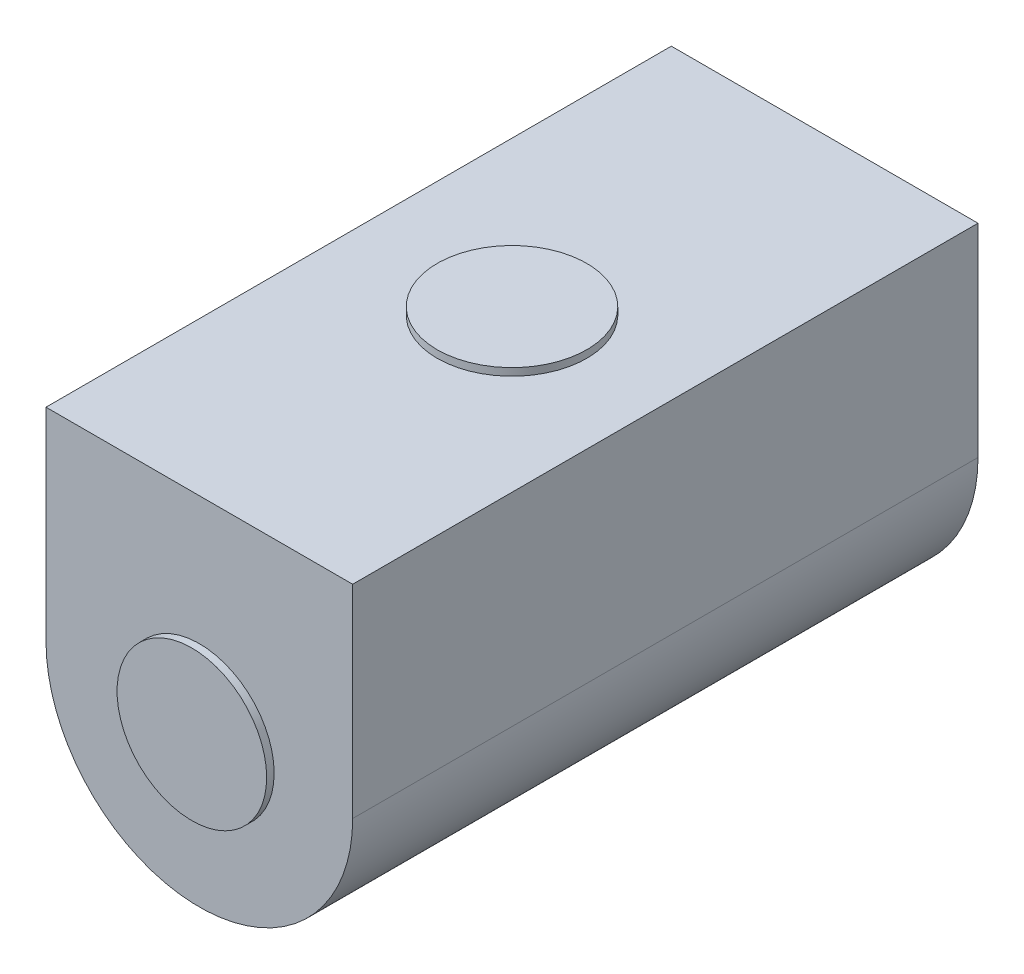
ISO-10303-21;
HEADER;
FILE_DESCRIPTION(('STEP AP214'),'2;1');
FILE_NAME('part.step','',(''),(''),'','','');
FILE_SCHEMA(('AUTOMOTIVE_DESIGN { 1 0 10303 214 1 1 1 1 }'));
ENDSEC;
DATA;
#1=APPLICATION_CONTEXT('core data for automotive mechanical design processes');
#2=APPLICATION_PROTOCOL_DEFINITION('international standard','automotive_design',2000,#1);
#3=PRODUCT_CONTEXT('',#1,'mechanical');
#4=PRODUCT('Part','Part','',(#3));
#5=PRODUCT_RELATED_PRODUCT_CATEGORY('part','',(#4));
#6=PRODUCT_DEFINITION_FORMATION('','',#4);
#7=PRODUCT_DEFINITION_CONTEXT('part definition',#1,'design');
#8=PRODUCT_DEFINITION('design','',#6,#7);
#9=PRODUCT_DEFINITION_SHAPE('','',#8);
#10=(LENGTH_UNIT() NAMED_UNIT(*) SI_UNIT(.MILLI.,.METRE.));
#11=(NAMED_UNIT(*) PLANE_ANGLE_UNIT() SI_UNIT($,.RADIAN.));
#12=(NAMED_UNIT(*) SI_UNIT($,.STERADIAN.) SOLID_ANGLE_UNIT());
#13=UNCERTAINTY_MEASURE_WITH_UNIT(LENGTH_MEASURE(1.E-05),#10,'distance_accuracy_value','');
#14=(GEOMETRIC_REPRESENTATION_CONTEXT(3) GLOBAL_UNCERTAINTY_ASSIGNED_CONTEXT((#13)) GLOBAL_UNIT_ASSIGNED_CONTEXT((#10,
#11,#12)) REPRESENTATION_CONTEXT('',''));
#15=CARTESIAN_POINT('',(0.,0.,0.));
#16=DIRECTION('',(0.,0.,1.));
#17=DIRECTION('',(1.,0.,0.));
#18=AXIS2_PLACEMENT_3D('',#15,#16,#17);
#19=CARTESIAN_POINT('',(0.,13.5625,20.9));
#20=DIRECTION('',(0.,1.,0.));
#21=DIRECTION('',(0.,0.,1.));
#22=AXIS2_PLACEMENT_3D('',#19,#20,#21);
#23=PLANE('',#22);
#24=DIRECTION('',(1.,0.,0.));
#25=VECTOR('',#24,1.);
#26=CARTESIAN_POINT('',(0.,13.5625,-20.9));
#27=LINE('',#26,#25);
#28=CARTESIAN_POINT('',(-10.25,13.5625,-20.9));
#29=VERTEX_POINT('',#28);
#30=CARTESIAN_POINT('',(10.25,13.5625,-20.9));
#31=VERTEX_POINT('',#30);
#32=EDGE_CURVE('E119',#29,#31,#27,.T.);
#33=ORIENTED_EDGE('',*,*,#32,.F.);
#34=DIRECTION('',(0.,0.,-1.));
#35=VECTOR('',#34,1.);
#36=CARTESIAN_POINT('',(-10.25,13.5625,20.9));
#37=LINE('',#36,#35);
#38=CARTESIAN_POINT('',(-10.25,13.5625,20.9));
#39=VERTEX_POINT('',#38);
#40=EDGE_CURVE('E65',#39,#29,#37,.T.);
#41=ORIENTED_EDGE('',*,*,#40,.F.);
#42=DIRECTION('',(1.,0.,0.));
#43=VECTOR('',#42,1.);
#44=CARTESIAN_POINT('',(0.,13.5625,20.9));
#45=LINE('',#44,#43);
#46=CARTESIAN_POINT('',(10.25,13.5625,20.9));
#47=VERTEX_POINT('',#46);
#48=EDGE_CURVE('E108',#39,#47,#45,.T.);
#49=ORIENTED_EDGE('',*,*,#48,.T.);
#50=DIRECTION('',(0.,0.,-1.));
#51=VECTOR('',#50,1.);
#52=CARTESIAN_POINT('',(10.25,13.5625,20.9));
#53=LINE('',#52,#51);
#54=EDGE_CURVE('E78',#47,#31,#53,.T.);
#55=ORIENTED_EDGE('',*,*,#54,.T.);
#56=EDGE_LOOP('',(#33,#41,#49,#55));
#57=FACE_BOUND('',#56,.T.);
#58=CARTESIAN_POINT('',(0.,13.5625,0.));
#59=DIRECTION('',(0.,1.,0.));
#60=DIRECTION('',(0.,0.,1.));
#61=AXIS2_PLACEMENT_3D('',#58,#59,#60);
#62=CIRCLE('',#61,5.);
#63=CARTESIAN_POINT('',(0.,13.5625,5.));
#64=VERTEX_POINT('',#63);
#65=EDGE_CURVE('E137',#64,#64,#62,.T.);
#66=ORIENTED_EDGE('',*,*,#65,.F.);
#67=EDGE_LOOP('',(#66));
#68=FACE_BOUND('',#67,.T.);
#69=ADVANCED_FACE('F48',(#57,#68),#23,.T.);
#70=CARTESIAN_POINT('',(0.,-22.9250469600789,20.9));
#71=DIRECTION('',(0.,0.,1.));
#72=DIRECTION('',(1.,0.,0.));
#73=AXIS2_PLACEMENT_3D('',#70,#71,#72);
#74=PLANE('',#73);
#75=DIRECTION('',(0.,1.,0.));
#76=VECTOR('',#75,1.);
#77=CARTESIAN_POINT('',(-10.25,-22.9250469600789,20.9));
#78=LINE('',#77,#76);
#79=CARTESIAN_POINT('',(-10.25,0.,20.9));
#80=VERTEX_POINT('',#79);
#81=EDGE_CURVE('E98',#80,#39,#78,.T.);
#82=ORIENTED_EDGE('',*,*,#81,.F.);
#83=CARTESIAN_POINT('',(0.,0.,20.9));
#84=DIRECTION('',(0.,0.,1.));
#85=DIRECTION('',(1.,0.,0.));
#86=AXIS2_PLACEMENT_3D('',#83,#84,#85);
#87=CIRCLE('',#86,10.25);
#88=CARTESIAN_POINT('',(10.25,0.,20.9));
#89=VERTEX_POINT('',#88);
#90=EDGE_CURVE('E91',#80,#89,#87,.T.);
#91=ORIENTED_EDGE('',*,*,#90,.T.);
#92=DIRECTION('',(0.,-1.,0.));
#93=VECTOR('',#92,1.);
#94=CARTESIAN_POINT('',(10.25,-22.9250469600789,20.9));
#95=LINE('',#94,#93);
#96=EDGE_CURVE('E97',#47,#89,#95,.T.);
#97=ORIENTED_EDGE('',*,*,#96,.F.);
#98=ORIENTED_EDGE('',*,*,#48,.F.);
#99=EDGE_LOOP('',(#82,#91,#97,#98));
#100=FACE_BOUND('',#99,.T.);
#101=CARTESIAN_POINT('',(0.,0.,20.9));
#102=DIRECTION('',(0.,0.,1.));
#103=DIRECTION('',(1.,0.,0.));
#104=AXIS2_PLACEMENT_3D('',#101,#102,#103);
#105=CIRCLE('',#104,5.);
#106=CARTESIAN_POINT('',(5.,0.,20.9));
#107=VERTEX_POINT('',#106);
#108=EDGE_CURVE('E125',#107,#107,#105,.T.);
#109=ORIENTED_EDGE('',*,*,#108,.F.);
#110=EDGE_LOOP('',(#109));
#111=FACE_BOUND('',#110,.T.);
#112=ADVANCED_FACE('F93',(#100,#111),#74,.T.);
#113=CARTESIAN_POINT('',(0.,0.,20.9));
#114=DIRECTION('',(0.,0.,-1.));
#115=DIRECTION('',(-1.,0.,0.));
#116=AXIS2_PLACEMENT_3D('',#113,#114,#115);
#117=CYLINDRICAL_SURFACE('',#116,10.25);
#118=CARTESIAN_POINT('',(0.,0.,-20.9));
#119=DIRECTION('',(0.,0.,1.));
#120=DIRECTION('',(1.,0.,0.));
#121=AXIS2_PLACEMENT_3D('',#118,#119,#120);
#122=CIRCLE('',#121,10.25);
#123=CARTESIAN_POINT('',(-10.25,0.,-20.9));
#124=VERTEX_POINT('',#123);
#125=CARTESIAN_POINT('',(10.25,0.,-20.9));
#126=VERTEX_POINT('',#125);
#127=EDGE_CURVE('E104',#124,#126,#122,.T.);
#128=ORIENTED_EDGE('',*,*,#127,.T.);
#129=DIRECTION('',(0.,0.,-1.));
#130=VECTOR('',#129,1.);
#131=CARTESIAN_POINT('',(10.25,0.,20.9));
#132=LINE('',#131,#130);
#133=EDGE_CURVE('E57',#89,#126,#132,.T.);
#134=ORIENTED_EDGE('',*,*,#133,.F.);
#135=ORIENTED_EDGE('',*,*,#90,.F.);
#136=DIRECTION('',(0.,0.,-1.));
#137=VECTOR('',#136,1.);
#138=CARTESIAN_POINT('',(-10.25,0.,20.9));
#139=LINE('',#138,#137);
#140=EDGE_CURVE('E12',#80,#124,#139,.T.);
#141=ORIENTED_EDGE('',*,*,#140,.T.);
#142=EDGE_LOOP('',(#128,#134,#135,#141));
#143=FACE_BOUND('',#142,.T.);
#144=ADVANCED_FACE('F102',(#143),#117,.T.);
#145=CARTESIAN_POINT('',(10.25,-22.9250469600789,20.9));
#146=DIRECTION('',(1.,0.,0.));
#147=DIRECTION('',(0.,0.,-1.));
#148=AXIS2_PLACEMENT_3D('',#145,#146,#147);
#149=PLANE('',#148);
#150=DIRECTION('',(0.,-1.,0.));
#151=VECTOR('',#150,1.);
#152=CARTESIAN_POINT('',(10.25,-22.9250469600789,-20.9));
#153=LINE('',#152,#151);
#154=EDGE_CURVE('E117',#31,#126,#153,.T.);
#155=ORIENTED_EDGE('',*,*,#154,.F.);
#156=ORIENTED_EDGE('',*,*,#54,.F.);
#157=ORIENTED_EDGE('',*,*,#96,.T.);
#158=ORIENTED_EDGE('',*,*,#133,.T.);
#159=EDGE_LOOP('',(#155,#156,#157,#158));
#160=FACE_BOUND('',#159,.T.);
#161=ADVANCED_FACE('F107',(#160),#149,.T.);
#162=CARTESIAN_POINT('',(-10.25,-22.9250469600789,20.9));
#163=DIRECTION('',(-1.,0.,0.));
#164=DIRECTION('',(0.,0.,1.));
#165=AXIS2_PLACEMENT_3D('',#162,#163,#164);
#166=PLANE('',#165);
#167=DIRECTION('',(0.,1.,0.));
#168=VECTOR('',#167,1.);
#169=CARTESIAN_POINT('',(-10.25,-22.9250469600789,-20.9));
#170=LINE('',#169,#168);
#171=EDGE_CURVE('E113',#124,#29,#170,.T.);
#172=ORIENTED_EDGE('',*,*,#171,.F.);
#173=ORIENTED_EDGE('',*,*,#140,.F.);
#174=ORIENTED_EDGE('',*,*,#81,.T.);
#175=ORIENTED_EDGE('',*,*,#40,.T.);
#176=EDGE_LOOP('',(#172,#173,#174,#175));
#177=FACE_BOUND('',#176,.T.);
#178=ADVANCED_FACE('F50',(#177),#166,.T.);
#179=CARTESIAN_POINT('',(0.,-22.9250469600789,-20.9));
#180=DIRECTION('',(0.,0.,1.));
#181=DIRECTION('',(1.,0.,0.));
#182=AXIS2_PLACEMENT_3D('',#179,#180,#181);
#183=PLANE('',#182);
#184=CARTESIAN_POINT('',(0.,0.,-20.9));
#185=DIRECTION('',(0.,0.,1.));
#186=DIRECTION('',(1.,0.,0.));
#187=AXIS2_PLACEMENT_3D('',#184,#185,#186);
#188=CIRCLE('',#187,5.);
#189=CARTESIAN_POINT('',(5.,0.,-20.9));
#190=VERTEX_POINT('',#189);
#191=EDGE_CURVE('E131',#190,#190,#188,.T.);
#192=ORIENTED_EDGE('',*,*,#191,.T.);
#193=EDGE_LOOP('',(#192));
#194=FACE_BOUND('',#193,.T.);
#195=ORIENTED_EDGE('',*,*,#171,.T.);
#196=ORIENTED_EDGE('',*,*,#32,.T.);
#197=ORIENTED_EDGE('',*,*,#154,.T.);
#198=ORIENTED_EDGE('',*,*,#127,.F.);
#199=EDGE_LOOP('',(#195,#196,#197,#198));
#200=FACE_BOUND('',#199,.T.);
#201=ADVANCED_FACE('F160',(#194,#200),#183,.F.);
#202=CARTESIAN_POINT('',(0.,0.,21.4));
#203=DIRECTION('',(0.,0.,-1.));
#204=DIRECTION('',(-1.,0.,0.));
#205=AXIS2_PLACEMENT_3D('',#202,#203,#204);
#206=CYLINDRICAL_SURFACE('',#205,5.);
#207=CARTESIAN_POINT('',(0.,0.,21.4));
#208=DIRECTION('',(0.,0.,1.));
#209=DIRECTION('',(1.,0.,0.));
#210=AXIS2_PLACEMENT_3D('',#207,#208,#209);
#211=CIRCLE('',#210,5.);
#212=CARTESIAN_POINT('',(5.,0.,21.4));
#213=VERTEX_POINT('',#212);
#214=EDGE_CURVE('E115',#213,#213,#211,.T.);
#215=ORIENTED_EDGE('',*,*,#214,.F.);
#216=EDGE_LOOP('',(#215));
#217=FACE_BOUND('',#216,.T.);
#218=ORIENTED_EDGE('',*,*,#108,.T.);
#219=EDGE_LOOP('',(#218));
#220=FACE_BOUND('',#219,.T.);
#221=ADVANCED_FACE('F182',(#217,#220),#206,.T.);
#222=CARTESIAN_POINT('',(0.,0.,21.4));
#223=DIRECTION('',(0.,0.,1.));
#224=DIRECTION('',(1.,0.,0.));
#225=AXIS2_PLACEMENT_3D('',#222,#223,#224);
#226=PLANE('',#225);
#227=ORIENTED_EDGE('',*,*,#214,.T.);
#228=EDGE_LOOP('',(#227));
#229=FACE_BOUND('',#228,.T.);
#230=ADVANCED_FACE('F191',(#229),#226,.T.);
#231=CARTESIAN_POINT('',(0.,0.,-21.4));
#232=DIRECTION('',(0.,0.,1.));
#233=DIRECTION('',(1.,0.,0.));
#234=AXIS2_PLACEMENT_3D('',#231,#232,#233);
#235=CYLINDRICAL_SURFACE('',#234,5.);
#236=CARTESIAN_POINT('',(0.,0.,-21.4));
#237=DIRECTION('',(0.,0.,1.));
#238=DIRECTION('',(1.,0.,0.));
#239=AXIS2_PLACEMENT_3D('',#236,#237,#238);
#240=CIRCLE('',#239,5.);
#241=CARTESIAN_POINT('',(5.,0.,-21.4));
#242=VERTEX_POINT('',#241);
#243=EDGE_CURVE('E128',#242,#242,#240,.T.);
#244=ORIENTED_EDGE('',*,*,#243,.T.);
#245=EDGE_LOOP('',(#244));
#246=FACE_BOUND('',#245,.T.);
#247=ORIENTED_EDGE('',*,*,#191,.F.);
#248=EDGE_LOOP('',(#247));
#249=FACE_BOUND('',#248,.T.);
#250=ADVANCED_FACE('F198',(#246,#249),#235,.T.);
#251=CARTESIAN_POINT('',(0.,0.,-21.4));
#252=DIRECTION('',(0.,0.,-1.));
#253=DIRECTION('',(1.,0.,0.));
#254=AXIS2_PLACEMENT_3D('',#251,#252,#253);
#255=PLANE('',#254);
#256=ORIENTED_EDGE('',*,*,#243,.F.);
#257=EDGE_LOOP('',(#256));
#258=FACE_BOUND('',#257,.T.);
#259=ADVANCED_FACE('F148',(#258),#255,.T.);
#260=CARTESIAN_POINT('',(0.,14.0625,0.));
#261=DIRECTION('',(0.,-1.,0.));
#262=DIRECTION('',(0.,0.,-1.));
#263=AXIS2_PLACEMENT_3D('',#260,#261,#262);
#264=CYLINDRICAL_SURFACE('',#263,5.);
#265=CARTESIAN_POINT('',(0.,14.0625,0.));
#266=DIRECTION('',(0.,1.,0.));
#267=DIRECTION('',(0.,0.,1.));
#268=AXIS2_PLACEMENT_3D('',#265,#266,#267);
#269=CIRCLE('',#268,5.);
#270=CARTESIAN_POINT('',(0.,14.0625,5.));
#271=VERTEX_POINT('',#270);
#272=EDGE_CURVE('E134',#271,#271,#269,.T.);
#273=ORIENTED_EDGE('',*,*,#272,.F.);
#274=EDGE_LOOP('',(#273));
#275=FACE_BOUND('',#274,.T.);
#276=ORIENTED_EDGE('',*,*,#65,.T.);
#277=EDGE_LOOP('',(#276));
#278=FACE_BOUND('',#277,.T.);
#279=ADVANCED_FACE('F145',(#275,#278),#264,.T.);
#280=CARTESIAN_POINT('',(0.,14.0625,0.));
#281=DIRECTION('',(0.,1.,0.));
#282=DIRECTION('',(0.,0.,1.));
#283=AXIS2_PLACEMENT_3D('',#280,#281,#282);
#284=PLANE('',#283);
#285=ORIENTED_EDGE('',*,*,#272,.T.);
#286=EDGE_LOOP('',(#285));
#287=FACE_BOUND('',#286,.T.);
#288=ADVANCED_FACE('F143',(#287),#284,.T.);
#289=CLOSED_SHELL('',(#69,#112,#144,#161,#178,#201,#221,#230,#250,#259,#279,#288));
#290=MANIFOLD_SOLID_BREP('B2',#289);
#291=ADVANCED_BREP_SHAPE_REPRESENTATION('',(#18,#290),#14);
#292=SHAPE_DEFINITION_REPRESENTATION(#9,#291);
ENDSEC;
END-ISO-10303-21;
